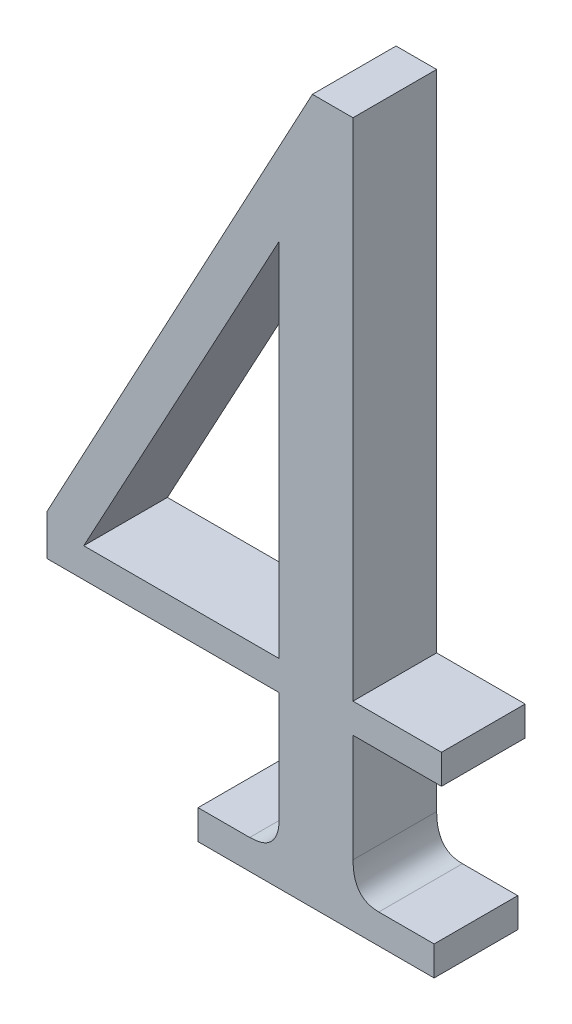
from build123d import *

# Parameters (mm, degrees)
EXTRUDE_1_DEPTH = 3


with BuildPart() as part:
    # Sketch 1 → Extrude 1 (new body)
    with BuildSketch(Plane.XY):
        with BuildLine():
            Line((10.846560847, 23.941798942), (12.301587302, 23.941798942))
            Line((12.301587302, 23.941798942), (12.301587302, 5.82010582))
            Line((12.301587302, 5.82010582), (15.476190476, 5.82010582))
            Line((15.476190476, 5.82010582), (15.476190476, 4.761904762))
            Line((15.476190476, 4.761904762), (12.301587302, 4.761904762))
            Line((12.301587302, 4.761904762), (12.301587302, 0.891632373))
            add(Edge.make_bspline(
                [(12.301587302, 0.891632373), (12.304057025, 0.80162671), (12.308716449, 0.631820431), (12.35217206, 0.393544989), (12.42472519, 0.19127385), (12.52370233, 0.020547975), (12.658593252, -0.10845998), (12.823709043, -0.200554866), (13.01696574, -0.253258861), (13.155337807, -0.260679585), (13.227513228, -0.264550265)],
                knots=[0, 0, 0, 0, 1.277017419, 2.409243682, 3.421406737, 4.316022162, 5.185037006, 6.036241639, 6.975695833, 8, 8, 8, 8], degree=3))
            Line((13.227513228, -0.264550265), (15.211640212, -0.264550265))
            Line((15.211640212, -0.264550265), (15.211640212, -1.322751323))
            Line((15.211640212, -1.322751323), (6.746031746, -1.322751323))
            Line((6.746031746, -1.322751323), (6.746031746, -0.264550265))
            Line((6.746031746, -0.264550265), (8.597883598, -0.264550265))
            add(Edge.make_bspline(
                [(8.597883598, -0.264550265), (8.681532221, -0.260950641), (8.839341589, -0.254159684), (9.058882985, -0.199812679), (9.247955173, -0.112378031), (9.397904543, 0.021250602), (9.519901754, 0.186883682), (9.600937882, 0.392565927), (9.650201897, 0.631258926), (9.654049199, 0.801542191), (9.656084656, 0.891632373)],
                knots=[0, 0, 0, 0, 1.116173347, 2.105744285, 3.00350018, 3.869679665, 4.759980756, 5.728398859, 6.798185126, 8, 8, 8, 8], degree=3))
            Line((9.656084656, 0.891632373), (9.656084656, 4.761904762))
            Line((9.656084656, 4.761904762), (1.322751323, 4.761904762))
            Line((1.322751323, 4.761904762), (1.322751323, 6.216931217))
            Line((1.322751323, 6.216931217), (10.846560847, 23.941798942))
        make_face()
        Polygon((9.656084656, 5.82010582), (9.656084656, 18.783068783), (2.645502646, 5.82010582), align=None, mode=Mode.SUBTRACT)
    extrude(amount=EXTRUDE_1_DEPTH)


solid = part.part
